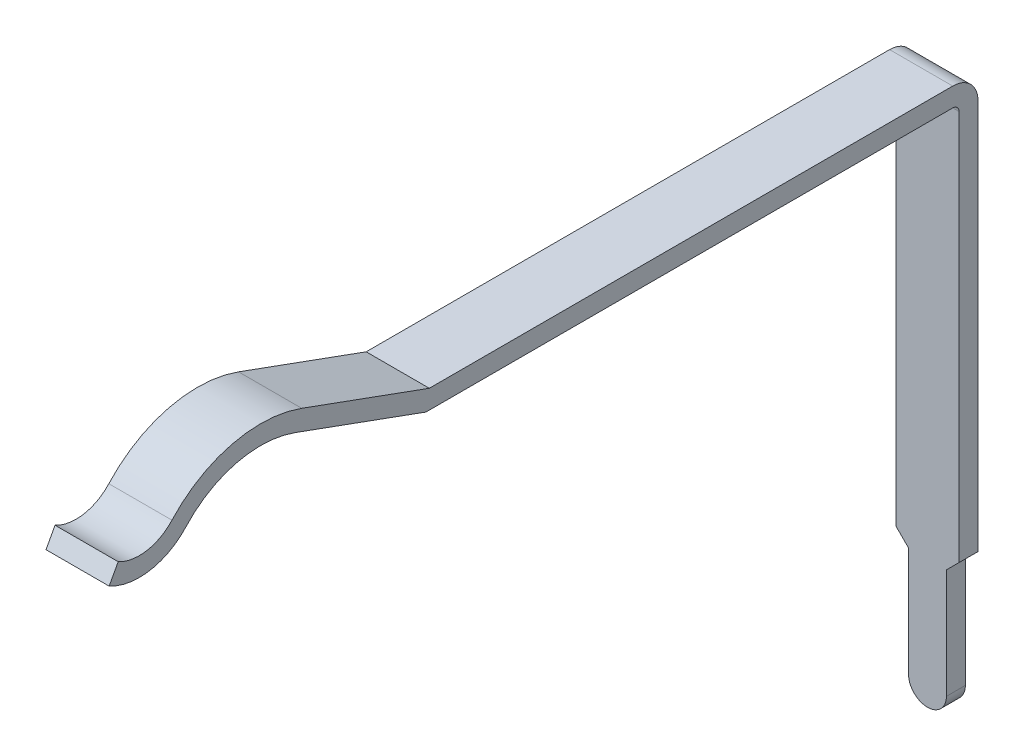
from build123d import *

# Parameters (mm, degrees)
EXTRUDE_THIN1_DEPTH = 0.5
CUT_EXTRUDE1_DEPTH  = 18.049868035


with BuildPart() as part:
    # Sketch1 → Extrude-Thin1 (new, symmetric)
    with BuildSketch(Plane(origin=(0, 0, 0), x_dir=(0, 0, -1), z_dir=(1, 0, 0))):
        with BuildLine():
            ThreePointArc((1, 0.121157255), (1.643863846, 0.014001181), (2.216684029, 0.326923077))
            ThreePointArc((2.216684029, 0.326923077), (3.017058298, 0.803497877), (3.947232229, 0.753508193))
            Line((3.947232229, 0.753508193), (6.017478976, 0))
            Line((6.017478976, 0), (14.36, 0))
            ThreePointArc((14.36, 0), (14.430710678, -0.029289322), (14.46, -0.1))
            Line((14.46, -0.1), (14.46, -8.52))
            Line((14.46, -8.52), (14.76, -8.52))
            Line((14.76, -8.52), (14.76, -0.1))
            ThreePointArc((14.76, -0.1), (14.642842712, 0.182842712), (14.36, 0.3))
            Line((14.36, 0.3), (6.07037707, 0.3))
            Line((6.07037707, 0.3), (4.049838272, 1.035415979))
            ThreePointArc((4.049838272, 1.035415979), (2.945256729, 1.094778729), (1.994812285, 0.528846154))
            ThreePointArc((1.994812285, 0.528846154), (1.593838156, 0.309800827), (1.143133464, 0.384810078))
            Line((1.143133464, 0.384810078), (1, 0.121157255))
        make_face()
    extrude(amount=EXTRUDE_THIN1_DEPTH, both=True)

    # Sketch2 → Cut-Extrude1 (cut, through all)
    with BuildSketch(Plane.XY):
        with BuildLine():
            Line((-0.3, -8.22), (-0.3, -6.485265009))
            Line((-0.3, -6.485265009), (-0.5, -6.285265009))
            Line((-0.5, -6.285265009), (-0.5, -9.22))
            Line((-0.5, -9.22), (0.5, -9.22))
            Line((0.5, -9.22), (0.5, -6.285265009))
            Line((0.5, -6.285265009), (0.3, -6.485265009))
            Line((0.3, -6.485265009), (0.3, -8.22))
            ThreePointArc((0.3, -8.22), (0, -8.52), (-0.3, -8.22))
        make_face()
    extrude(amount=-CUT_EXTRUDE1_DEPTH, mode=Mode.SUBTRACT)


solid = part.part
